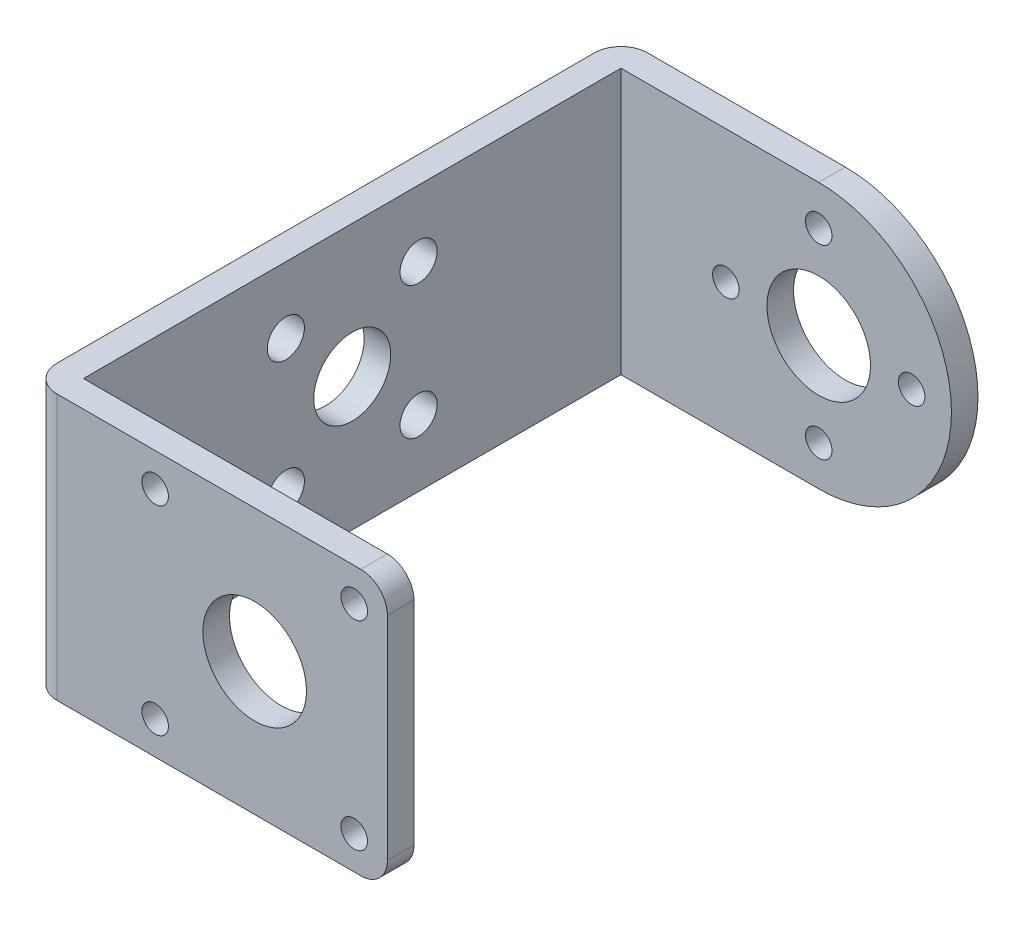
ISO-10303-21;
HEADER;
FILE_DESCRIPTION(('STEP AP214'),'2;1');
FILE_NAME('part.step','',(''),(''),'','','');
FILE_SCHEMA(('AUTOMOTIVE_DESIGN { 1 0 10303 214 1 1 1 1 }'));
ENDSEC;
DATA;
#1=APPLICATION_CONTEXT('core data for automotive mechanical design processes');
#2=APPLICATION_PROTOCOL_DEFINITION('international standard','automotive_design',2000,#1);
#3=PRODUCT_CONTEXT('',#1,'mechanical');
#4=PRODUCT('Part','Part','',(#3));
#5=PRODUCT_RELATED_PRODUCT_CATEGORY('part','',(#4));
#6=PRODUCT_DEFINITION_FORMATION('','',#4);
#7=PRODUCT_DEFINITION_CONTEXT('part definition',#1,'design');
#8=PRODUCT_DEFINITION('design','',#6,#7);
#9=PRODUCT_DEFINITION_SHAPE('','',#8);
#10=(LENGTH_UNIT() NAMED_UNIT(*) SI_UNIT(.MILLI.,.METRE.));
#11=(NAMED_UNIT(*) PLANE_ANGLE_UNIT() SI_UNIT($,.RADIAN.));
#12=(NAMED_UNIT(*) SI_UNIT($,.STERADIAN.) SOLID_ANGLE_UNIT());
#13=UNCERTAINTY_MEASURE_WITH_UNIT(LENGTH_MEASURE(1.E-05),#10,'distance_accuracy_value','');
#14=(GEOMETRIC_REPRESENTATION_CONTEXT(3) GLOBAL_UNCERTAINTY_ASSIGNED_CONTEXT((#13)) GLOBAL_UNIT_ASSIGNED_CONTEXT((#10,
#11,#12)) REPRESENTATION_CONTEXT('',''));
#15=CARTESIAN_POINT('',(0.,0.,0.));
#16=DIRECTION('',(0.,0.,1.));
#17=DIRECTION('',(1.,0.,0.));
#18=AXIS2_PLACEMENT_3D('',#15,#16,#17);
#19=CARTESIAN_POINT('',(-13.45,0.,0.));
#20=DIRECTION('',(0.,1.,0.));
#21=DIRECTION('',(0.,0.,1.));
#22=AXIS2_PLACEMENT_3D('',#19,#20,#21);
#23=PLANE('',#22);
#24=CARTESIAN_POINT('',(-24.9,0.,20.25));
#25=DIRECTION('',(0.,1.,0.));
#26=DIRECTION('',(-0.707106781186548,0.,0.707106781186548));
#27=AXIS2_PLACEMENT_3D('',#24,#25,#26);
#28=CIRCLE('',#27,2.);
#29=CARTESIAN_POINT('',(-26.9,0.,20.25));
#30=VERTEX_POINT('',#29);
#31=CARTESIAN_POINT('',(-24.9,0.,22.25));
#32=VERTEX_POINT('',#31);
#33=EDGE_CURVE('E551',#30,#32,#28,.T.);
#34=ORIENTED_EDGE('',*,*,#33,.F.);
#35=DIRECTION('',(0.,0.,-1.));
#36=VECTOR('',#35,1.);
#37=CARTESIAN_POINT('',(-26.9,0.,22.25));
#38=LINE('',#37,#36);
#39=CARTESIAN_POINT('',(-26.9,0.,-20.25));
#40=VERTEX_POINT('',#39);
#41=EDGE_CURVE('E583',#30,#40,#38,.T.);
#42=ORIENTED_EDGE('',*,*,#41,.T.);
#43=CARTESIAN_POINT('',(-24.9,0.,-20.25));
#44=DIRECTION('',(0.,1.,0.));
#45=DIRECTION('',(-0.707106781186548,0.,-0.707106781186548));
#46=AXIS2_PLACEMENT_3D('',#43,#44,#45);
#47=CIRCLE('',#46,2.);
#48=CARTESIAN_POINT('',(-24.9,0.,-22.25));
#49=VERTEX_POINT('',#48);
#50=EDGE_CURVE('E328',#49,#40,#47,.T.);
#51=ORIENTED_EDGE('',*,*,#50,.F.);
#52=DIRECTION('',(1.,0.,0.));
#53=VECTOR('',#52,1.);
#54=CARTESIAN_POINT('',(-26.9,0.,-22.25));
#55=LINE('',#54,#53);
#56=CARTESIAN_POINT('',(-10.,0.,-22.25));
#57=VERTEX_POINT('',#56);
#58=EDGE_CURVE('E329',#49,#57,#55,.T.);
#59=ORIENTED_EDGE('',*,*,#58,.T.);
#60=DIRECTION('',(0.,0.,-1.));
#61=VECTOR('',#60,1.);
#62=CARTESIAN_POINT('',(-10.,0.,-22.25));
#63=LINE('',#62,#61);
#64=CARTESIAN_POINT('',(-10.,0.,-20.25));
#65=VERTEX_POINT('',#64);
#66=EDGE_CURVE('E478',#65,#57,#63,.T.);
#67=ORIENTED_EDGE('',*,*,#66,.F.);
#68=DIRECTION('',(1.,0.,0.));
#69=VECTOR('',#68,1.);
#70=CARTESIAN_POINT('',(-24.9,0.,-20.25));
#71=LINE('',#70,#69);
#72=CARTESIAN_POINT('',(-24.9,0.,-20.25));
#73=VERTEX_POINT('',#72);
#74=EDGE_CURVE('E20',#73,#65,#71,.T.);
#75=ORIENTED_EDGE('',*,*,#74,.F.);
#76=DIRECTION('',(0.,0.,-1.));
#77=VECTOR('',#76,1.);
#78=CARTESIAN_POINT('',(-24.9,0.,20.25));
#79=LINE('',#78,#77);
#80=CARTESIAN_POINT('',(-24.9,0.,20.25));
#81=VERTEX_POINT('',#80);
#82=EDGE_CURVE('E11',#81,#73,#79,.T.);
#83=ORIENTED_EDGE('',*,*,#82,.F.);
#84=DIRECTION('',(-1.,0.,0.));
#85=VECTOR('',#84,1.);
#86=CARTESIAN_POINT('',(0.,0.,20.25));
#87=LINE('',#86,#85);
#88=CARTESIAN_POINT('',(-2.,0.,20.25));
#89=VERTEX_POINT('',#88);
#90=EDGE_CURVE('E367',#89,#81,#87,.T.);
#91=ORIENTED_EDGE('',*,*,#90,.F.);
#92=DIRECTION('',(0.,0.,-1.));
#93=VECTOR('',#92,1.);
#94=CARTESIAN_POINT('',(-2.,0.,11.125));
#95=LINE('',#94,#93);
#96=CARTESIAN_POINT('',(-2.,0.,22.25));
#97=VERTEX_POINT('',#96);
#98=EDGE_CURVE('E350',#97,#89,#95,.T.);
#99=ORIENTED_EDGE('',*,*,#98,.F.);
#100=DIRECTION('',(-1.,0.,0.));
#101=VECTOR('',#100,1.);
#102=CARTESIAN_POINT('',(0.,0.,22.25));
#103=LINE('',#102,#101);
#104=EDGE_CURVE('E510',#97,#32,#103,.T.);
#105=ORIENTED_EDGE('',*,*,#104,.T.);
#106=EDGE_LOOP('',(#34,#42,#51,#59,#67,#75,#83,#91,#99,#105));
#107=FACE_BOUND('',#106,.T.);
#108=ADVANCED_FACE('F17',(#107),#23,.F.);
#109=CARTESIAN_POINT('',(-24.9,0.,20.25));
#110=DIRECTION('',(1.,0.,0.));
#111=DIRECTION('',(0.,-1.,0.));
#112=AXIS2_PLACEMENT_3D('',#109,#110,#111);
#113=PLANE('',#112);
#114=CARTESIAN_POINT('',(-24.9,5.,5.));
#115=DIRECTION('',(-1.,0.,0.));
#116=DIRECTION('',(0.,0.,1.));
#117=AXIS2_PLACEMENT_3D('',#114,#115,#116);
#118=CIRCLE('',#117,1.4);
#119=CARTESIAN_POINT('',(-24.9,5.,3.6));
#120=VERTEX_POINT('',#119);
#121=EDGE_CURVE('E445',#120,#120,#118,.T.);
#122=ORIENTED_EDGE('',*,*,#121,.T.);
#123=EDGE_LOOP('',(#122));
#124=FACE_BOUND('',#123,.T.);
#125=CARTESIAN_POINT('',(-24.9,10.,0.));
#126=DIRECTION('',(-1.,0.,0.));
#127=DIRECTION('',(0.,0.,1.));
#128=AXIS2_PLACEMENT_3D('',#125,#126,#127);
#129=CIRCLE('',#128,2.9);
#130=CARTESIAN_POINT('',(-24.9,10.,-2.9));
#131=VERTEX_POINT('',#130);
#132=EDGE_CURVE('E434',#131,#131,#129,.T.);
#133=ORIENTED_EDGE('',*,*,#132,.T.);
#134=EDGE_LOOP('',(#133));
#135=FACE_BOUND('',#134,.T.);
#136=CARTESIAN_POINT('',(-24.9,15.,5.));
#137=DIRECTION('',(-1.,0.,0.));
#138=DIRECTION('',(0.,0.,1.));
#139=AXIS2_PLACEMENT_3D('',#136,#137,#138);
#140=CIRCLE('',#139,1.4);
#141=CARTESIAN_POINT('',(-24.9,15.,3.6));
#142=VERTEX_POINT('',#141);
#143=EDGE_CURVE('E261',#142,#142,#140,.T.);
#144=ORIENTED_EDGE('',*,*,#143,.T.);
#145=EDGE_LOOP('',(#144));
#146=FACE_BOUND('',#145,.T.);
#147=CARTESIAN_POINT('',(-24.9,5.,-5.));
#148=DIRECTION('',(-1.,0.,0.));
#149=DIRECTION('',(0.,0.,1.));
#150=AXIS2_PLACEMENT_3D('',#147,#148,#149);
#151=CIRCLE('',#150,1.4);
#152=CARTESIAN_POINT('',(-24.9,5.,-6.4));
#153=VERTEX_POINT('',#152);
#154=EDGE_CURVE('E263',#153,#153,#151,.T.);
#155=ORIENTED_EDGE('',*,*,#154,.T.);
#156=EDGE_LOOP('',(#155));
#157=FACE_BOUND('',#156,.T.);
#158=CARTESIAN_POINT('',(-24.9,15.,-5.));
#159=DIRECTION('',(-1.,0.,0.));
#160=DIRECTION('',(0.,0.,1.));
#161=AXIS2_PLACEMENT_3D('',#158,#159,#160);
#162=CIRCLE('',#161,1.4);
#163=CARTESIAN_POINT('',(-24.9,15.,-6.4));
#164=VERTEX_POINT('',#163);
#165=EDGE_CURVE('E421',#164,#164,#162,.T.);
#166=ORIENTED_EDGE('',*,*,#165,.T.);
#167=EDGE_LOOP('',(#166));
#168=FACE_BOUND('',#167,.T.);
#169=ORIENTED_EDGE('',*,*,#82,.T.);
#170=DIRECTION('',(0.,1.,0.));
#171=VECTOR('',#170,1.);
#172=CARTESIAN_POINT('',(-24.9,0.,-20.25));
#173=LINE('',#172,#171);
#174=CARTESIAN_POINT('',(-24.9,20.,-20.25));
#175=VERTEX_POINT('',#174);
#176=EDGE_CURVE('E507',#73,#175,#173,.T.);
#177=ORIENTED_EDGE('',*,*,#176,.T.);
#178=DIRECTION('',(0.,0.,-1.));
#179=VECTOR('',#178,1.);
#180=CARTESIAN_POINT('',(-24.9,20.,20.25));
#181=LINE('',#180,#179);
#182=CARTESIAN_POINT('',(-24.9,20.,20.25));
#183=VERTEX_POINT('',#182);
#184=EDGE_CURVE('E285',#183,#175,#181,.T.);
#185=ORIENTED_EDGE('',*,*,#184,.F.);
#186=DIRECTION('',(0.,1.,0.));
#187=VECTOR('',#186,1.);
#188=CARTESIAN_POINT('',(-24.9,0.,20.25));
#189=LINE('',#188,#187);
#190=EDGE_CURVE('E372',#81,#183,#189,.T.);
#191=ORIENTED_EDGE('',*,*,#190,.F.);
#192=EDGE_LOOP('',(#169,#177,#185,#191));
#193=FACE_BOUND('',#192,.T.);
#194=ADVANCED_FACE('F534',(#124,#135,#146,#157,#168,#193),#113,.T.);
#195=CARTESIAN_POINT('',(-24.9,0.,-20.25));
#196=DIRECTION('',(0.,0.,1.));
#197=DIRECTION('',(0.,1.,0.));
#198=AXIS2_PLACEMENT_3D('',#195,#196,#197);
#199=PLANE('',#198);
#200=CARTESIAN_POINT('',(-10.,17.,-20.25));
#201=DIRECTION('',(0.,0.,-1.));
#202=DIRECTION('',(-1.,0.,0.));
#203=AXIS2_PLACEMENT_3D('',#200,#201,#202);
#204=CIRCLE('',#203,1.);
#205=CARTESIAN_POINT('',(-9.,17.,-20.25));
#206=VERTEX_POINT('',#205);
#207=EDGE_CURVE('E322',#206,#206,#204,.T.);
#208=ORIENTED_EDGE('',*,*,#207,.T.);
#209=EDGE_LOOP('',(#208));
#210=FACE_BOUND('',#209,.T.);
#211=CARTESIAN_POINT('',(-10.,10.,-20.25));
#212=DIRECTION('',(0.,0.,-1.));
#213=DIRECTION('',(-1.,0.,0.));
#214=AXIS2_PLACEMENT_3D('',#211,#212,#213);
#215=CIRCLE('',#214,3.9);
#216=CARTESIAN_POINT('',(-6.1,10.,-20.25));
#217=VERTEX_POINT('',#216);
#218=EDGE_CURVE('E489',#217,#217,#215,.T.);
#219=ORIENTED_EDGE('',*,*,#218,.T.);
#220=EDGE_LOOP('',(#219));
#221=FACE_BOUND('',#220,.T.);
#222=CARTESIAN_POINT('',(-17.,10.,-20.25));
#223=DIRECTION('',(0.,0.,-1.));
#224=DIRECTION('',(-1.,0.,0.));
#225=AXIS2_PLACEMENT_3D('',#222,#223,#224);
#226=CIRCLE('',#225,1.);
#227=CARTESIAN_POINT('',(-16.,10.,-20.25));
#228=VERTEX_POINT('',#227);
#229=EDGE_CURVE('E341',#228,#228,#226,.T.);
#230=ORIENTED_EDGE('',*,*,#229,.T.);
#231=EDGE_LOOP('',(#230));
#232=FACE_BOUND('',#231,.T.);
#233=CARTESIAN_POINT('',(-3.,10.,-20.25));
#234=DIRECTION('',(0.,0.,-1.));
#235=DIRECTION('',(-1.,0.,0.));
#236=AXIS2_PLACEMENT_3D('',#233,#234,#235);
#237=CIRCLE('',#236,1.);
#238=CARTESIAN_POINT('',(-2.,10.,-20.25));
#239=VERTEX_POINT('',#238);
#240=EDGE_CURVE('E463',#239,#239,#237,.T.);
#241=ORIENTED_EDGE('',*,*,#240,.T.);
#242=EDGE_LOOP('',(#241));
#243=FACE_BOUND('',#242,.T.);
#244=CARTESIAN_POINT('',(-10.,3.,-20.25));
#245=DIRECTION('',(0.,0.,-1.));
#246=DIRECTION('',(-1.,0.,0.));
#247=AXIS2_PLACEMENT_3D('',#244,#245,#246);
#248=CIRCLE('',#247,1.);
#249=CARTESIAN_POINT('',(-9.,3.,-20.25));
#250=VERTEX_POINT('',#249);
#251=EDGE_CURVE('E453',#250,#250,#248,.T.);
#252=ORIENTED_EDGE('',*,*,#251,.T.);
#253=EDGE_LOOP('',(#252));
#254=FACE_BOUND('',#253,.T.);
#255=CARTESIAN_POINT('',(-10.,10.,-20.25));
#256=DIRECTION('',(0.,0.,1.));
#257=DIRECTION('',(-1.,0.,0.));
#258=AXIS2_PLACEMENT_3D('',#255,#256,#257);
#259=CIRCLE('',#258,10.);
#260=CARTESIAN_POINT('',(-10.,20.,-20.25));
#261=VERTEX_POINT('',#260);
#262=EDGE_CURVE('E471',#65,#261,#259,.T.);
#263=ORIENTED_EDGE('',*,*,#262,.T.);
#264=DIRECTION('',(1.,0.,0.));
#265=VECTOR('',#264,1.);
#266=CARTESIAN_POINT('',(-24.9,20.,-20.25));
#267=LINE('',#266,#265);
#268=EDGE_CURVE('E287',#175,#261,#267,.T.);
#269=ORIENTED_EDGE('',*,*,#268,.F.);
#270=ORIENTED_EDGE('',*,*,#176,.F.);
#271=ORIENTED_EDGE('',*,*,#74,.T.);
#272=EDGE_LOOP('',(#263,#269,#270,#271));
#273=FACE_BOUND('',#272,.T.);
#274=ADVANCED_FACE('F518',(#210,#221,#232,#243,#254,#273),#199,.T.);
#275=CARTESIAN_POINT('',(-26.9,0.,22.25));
#276=DIRECTION('',(0.,0.,1.));
#277=DIRECTION('',(0.,1.,0.));
#278=AXIS2_PLACEMENT_3D('',#275,#276,#277);
#279=PLANE('',#278);
#280=CARTESIAN_POINT('',(-17.5,17.5,22.25));
#281=DIRECTION('',(0.,0.,-1.));
#282=DIRECTION('',(1.,0.,0.));
#283=AXIS2_PLACEMENT_3D('',#280,#281,#282);
#284=CIRCLE('',#283,1.);
#285=CARTESIAN_POINT('',(-18.5,17.5,22.25));
#286=VERTEX_POINT('',#285);
#287=EDGE_CURVE('E503',#286,#286,#284,.T.);
#288=ORIENTED_EDGE('',*,*,#287,.T.);
#289=EDGE_LOOP('',(#288));
#290=FACE_BOUND('',#289,.T.);
#291=CARTESIAN_POINT('',(-10.,10.,22.25));
#292=DIRECTION('',(0.,0.,-1.));
#293=DIRECTION('',(1.,0.,0.));
#294=AXIS2_PLACEMENT_3D('',#291,#292,#293);
#295=CIRCLE('',#294,3.9);
#296=CARTESIAN_POINT('',(-13.9,10.,22.25));
#297=VERTEX_POINT('',#296);
#298=EDGE_CURVE('E305',#297,#297,#295,.T.);
#299=ORIENTED_EDGE('',*,*,#298,.T.);
#300=EDGE_LOOP('',(#299));
#301=FACE_BOUND('',#300,.T.);
#302=CARTESIAN_POINT('',(-2.5,17.5,22.25));
#303=DIRECTION('',(0.,0.,-1.));
#304=DIRECTION('',(1.,0.,0.));
#305=AXIS2_PLACEMENT_3D('',#302,#303,#304);
#306=CIRCLE('',#305,1.);
#307=CARTESIAN_POINT('',(-3.5,17.5,22.25));
#308=VERTEX_POINT('',#307);
#309=EDGE_CURVE('E303',#308,#308,#306,.T.);
#310=ORIENTED_EDGE('',*,*,#309,.T.);
#311=EDGE_LOOP('',(#310));
#312=FACE_BOUND('',#311,.T.);
#313=CARTESIAN_POINT('',(-17.5,2.5,22.25));
#314=DIRECTION('',(0.,0.,-1.));
#315=DIRECTION('',(1.,0.,0.));
#316=AXIS2_PLACEMENT_3D('',#313,#314,#315);
#317=CIRCLE('',#316,1.);
#318=CARTESIAN_POINT('',(-18.5,2.5,22.25));
#319=VERTEX_POINT('',#318);
#320=EDGE_CURVE('E284',#319,#319,#317,.T.);
#321=ORIENTED_EDGE('',*,*,#320,.T.);
#322=EDGE_LOOP('',(#321));
#323=FACE_BOUND('',#322,.T.);
#324=CARTESIAN_POINT('',(-2.5,2.5,22.25));
#325=DIRECTION('',(0.,0.,-1.));
#326=DIRECTION('',(1.,0.,0.));
#327=AXIS2_PLACEMENT_3D('',#324,#325,#326);
#328=CIRCLE('',#327,1.);
#329=CARTESIAN_POINT('',(-3.5,2.5,22.25));
#330=VERTEX_POINT('',#329);
#331=EDGE_CURVE('E334',#330,#330,#328,.T.);
#332=ORIENTED_EDGE('',*,*,#331,.T.);
#333=EDGE_LOOP('',(#332));
#334=FACE_BOUND('',#333,.T.);
#335=DIRECTION('',(0.,1.,0.));
#336=VECTOR('',#335,1.);
#337=CARTESIAN_POINT('',(-24.9,0.,22.25));
#338=LINE('',#337,#336);
#339=CARTESIAN_POINT('',(-24.9,20.,22.25));
#340=VERTEX_POINT('',#339);
#341=EDGE_CURVE('E547',#32,#340,#338,.T.);
#342=ORIENTED_EDGE('',*,*,#341,.F.);
#343=ORIENTED_EDGE('',*,*,#104,.F.);
#344=CARTESIAN_POINT('',(-2.,2.,22.25));
#345=DIRECTION('',(0.,0.,-1.));
#346=DIRECTION('',(0.707106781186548,-0.707106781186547,0.));
#347=AXIS2_PLACEMENT_3D('',#344,#345,#346);
#348=CIRCLE('',#347,2.);
#349=CARTESIAN_POINT('',(0.,2.,22.25));
#350=VERTEX_POINT('',#349);
#351=EDGE_CURVE('E336',#350,#97,#348,.T.);
#352=ORIENTED_EDGE('',*,*,#351,.F.);
#353=DIRECTION('',(0.,1.,0.));
#354=VECTOR('',#353,1.);
#355=CARTESIAN_POINT('',(0.,0.,22.25));
#356=LINE('',#355,#354);
#357=CARTESIAN_POINT('',(0.,18.,22.25));
#358=VERTEX_POINT('',#357);
#359=EDGE_CURVE('E361',#350,#358,#356,.T.);
#360=ORIENTED_EDGE('',*,*,#359,.T.);
#361=CARTESIAN_POINT('',(-2.,18.,22.25));
#362=DIRECTION('',(0.,0.,-1.));
#363=DIRECTION('',(0.707106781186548,0.707106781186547,0.));
#364=AXIS2_PLACEMENT_3D('',#361,#362,#363);
#365=CIRCLE('',#364,2.);
#366=CARTESIAN_POINT('',(-2.,20.,22.25));
#367=VERTEX_POINT('',#366);
#368=EDGE_CURVE('E407',#367,#358,#365,.T.);
#369=ORIENTED_EDGE('',*,*,#368,.F.);
#370=DIRECTION('',(1.,0.,0.));
#371=VECTOR('',#370,1.);
#372=CARTESIAN_POINT('',(0.,20.,22.25));
#373=LINE('',#372,#371);
#374=EDGE_CURVE('E295',#340,#367,#373,.T.);
#375=ORIENTED_EDGE('',*,*,#374,.F.);
#376=EDGE_LOOP('',(#342,#343,#352,#360,#369,#375));
#377=FACE_BOUND('',#376,.T.);
#378=ADVANCED_FACE('F544',(#290,#301,#312,#323,#334,#377),#279,.T.);
#379=CARTESIAN_POINT('',(-17.5,17.5,22.25));
#380=DIRECTION('',(0.,0.,-1.));
#381=DIRECTION('',(1.,0.,0.));
#382=AXIS2_PLACEMENT_3D('',#379,#380,#381);
#383=CYLINDRICAL_SURFACE('',#382,1.);
#384=ORIENTED_EDGE('',*,*,#287,.F.);
#385=DIRECTION('',(0.,0.,-1.));
#386=VECTOR('',#385,1.);
#387=CARTESIAN_POINT('',(-18.5,17.5,22.25));
#388=LINE('',#387,#386);
#389=CARTESIAN_POINT('',(-18.5,17.5,20.25));
#390=VERTEX_POINT('',#389);
#391=EDGE_CURVE('E46',#286,#390,#388,.T.);
#392=ORIENTED_EDGE('',*,*,#391,.T.);
#393=CARTESIAN_POINT('',(-17.5,17.5,20.25));
#394=DIRECTION('',(0.,0.,1.));
#395=DIRECTION('',(1.,0.,0.));
#396=AXIS2_PLACEMENT_3D('',#393,#394,#395);
#397=CIRCLE('',#396,1.);
#398=EDGE_CURVE('E402',#390,#390,#397,.T.);
#399=ORIENTED_EDGE('',*,*,#398,.F.);
#400=ORIENTED_EDGE('',*,*,#391,.F.);
#401=EDGE_LOOP('',(#384,#392,#399,#400));
#402=FACE_BOUND('',#401,.T.);
#403=ADVANCED_FACE('F635',(#402),#383,.F.);
#404=CARTESIAN_POINT('',(-10.,10.,22.25));
#405=DIRECTION('',(0.,0.,-1.));
#406=DIRECTION('',(1.,0.,0.));
#407=AXIS2_PLACEMENT_3D('',#404,#405,#406);
#408=CYLINDRICAL_SURFACE('',#407,3.9);
#409=ORIENTED_EDGE('',*,*,#298,.F.);
#410=DIRECTION('',(0.,0.,-1.));
#411=VECTOR('',#410,1.);
#412=CARTESIAN_POINT('',(-13.9,10.,22.25));
#413=LINE('',#412,#411);
#414=CARTESIAN_POINT('',(-13.9,10.,20.25));
#415=VERTEX_POINT('',#414);
#416=EDGE_CURVE('E501',#297,#415,#413,.T.);
#417=ORIENTED_EDGE('',*,*,#416,.T.);
#418=CARTESIAN_POINT('',(-10.,10.,20.25));
#419=DIRECTION('',(0.,0.,1.));
#420=DIRECTION('',(1.,0.,0.));
#421=AXIS2_PLACEMENT_3D('',#418,#419,#420);
#422=CIRCLE('',#421,3.9);
#423=EDGE_CURVE('E399',#415,#415,#422,.T.);
#424=ORIENTED_EDGE('',*,*,#423,.F.);
#425=ORIENTED_EDGE('',*,*,#416,.F.);
#426=EDGE_LOOP('',(#409,#417,#424,#425));
#427=FACE_BOUND('',#426,.T.);
#428=ADVANCED_FACE('F638',(#427),#408,.F.);
#429=CARTESIAN_POINT('',(-2.5,17.5,22.25));
#430=DIRECTION('',(0.,0.,-1.));
#431=DIRECTION('',(1.,0.,0.));
#432=AXIS2_PLACEMENT_3D('',#429,#430,#431);
#433=CYLINDRICAL_SURFACE('',#432,1.);
#434=ORIENTED_EDGE('',*,*,#309,.F.);
#435=DIRECTION('',(0.,0.,-1.));
#436=VECTOR('',#435,1.);
#437=CARTESIAN_POINT('',(-3.5,17.5,22.25));
#438=LINE('',#437,#436);
#439=CARTESIAN_POINT('',(-3.5,17.5,20.25));
#440=VERTEX_POINT('',#439);
#441=EDGE_CURVE('E298',#308,#440,#438,.T.);
#442=ORIENTED_EDGE('',*,*,#441,.T.);
#443=CARTESIAN_POINT('',(-2.5,17.5,20.25));
#444=DIRECTION('',(0.,0.,1.));
#445=DIRECTION('',(1.,0.,0.));
#446=AXIS2_PLACEMENT_3D('',#443,#444,#445);
#447=CIRCLE('',#446,1.);
#448=EDGE_CURVE('E396',#440,#440,#447,.T.);
#449=ORIENTED_EDGE('',*,*,#448,.F.);
#450=ORIENTED_EDGE('',*,*,#441,.F.);
#451=EDGE_LOOP('',(#434,#442,#449,#450));
#452=FACE_BOUND('',#451,.T.);
#453=ADVANCED_FACE('F637',(#452),#433,.F.);
#454=CARTESIAN_POINT('',(-17.5,2.5,22.25));
#455=DIRECTION('',(0.,0.,-1.));
#456=DIRECTION('',(1.,0.,0.));
#457=AXIS2_PLACEMENT_3D('',#454,#455,#456);
#458=CYLINDRICAL_SURFACE('',#457,1.);
#459=ORIENTED_EDGE('',*,*,#320,.F.);
#460=DIRECTION('',(0.,0.,-1.));
#461=VECTOR('',#460,1.);
#462=CARTESIAN_POINT('',(-18.5,2.5,22.25));
#463=LINE('',#462,#461);
#464=CARTESIAN_POINT('',(-18.5,2.5,20.25));
#465=VERTEX_POINT('',#464);
#466=EDGE_CURVE('E378',#319,#465,#463,.T.);
#467=ORIENTED_EDGE('',*,*,#466,.T.);
#468=CARTESIAN_POINT('',(-17.5,2.5,20.25));
#469=DIRECTION('',(0.,0.,1.));
#470=DIRECTION('',(1.,0.,0.));
#471=AXIS2_PLACEMENT_3D('',#468,#469,#470);
#472=CIRCLE('',#471,1.);
#473=EDGE_CURVE('E389',#465,#465,#472,.T.);
#474=ORIENTED_EDGE('',*,*,#473,.F.);
#475=ORIENTED_EDGE('',*,*,#466,.F.);
#476=EDGE_LOOP('',(#459,#467,#474,#475));
#477=FACE_BOUND('',#476,.T.);
#478=ADVANCED_FACE('F613',(#477),#458,.F.);
#479=CARTESIAN_POINT('',(-2.5,2.5,22.25));
#480=DIRECTION('',(0.,0.,-1.));
#481=DIRECTION('',(1.,0.,0.));
#482=AXIS2_PLACEMENT_3D('',#479,#480,#481);
#483=CYLINDRICAL_SURFACE('',#482,1.);
#484=ORIENTED_EDGE('',*,*,#331,.F.);
#485=DIRECTION('',(0.,0.,-1.));
#486=VECTOR('',#485,1.);
#487=CARTESIAN_POINT('',(-3.5,2.5,22.25));
#488=LINE('',#487,#486);
#489=CARTESIAN_POINT('',(-3.5,2.5,20.25));
#490=VERTEX_POINT('',#489);
#491=EDGE_CURVE('E392',#330,#490,#488,.T.);
#492=ORIENTED_EDGE('',*,*,#491,.T.);
#493=CARTESIAN_POINT('',(-2.5,2.5,20.25));
#494=DIRECTION('',(0.,0.,1.));
#495=DIRECTION('',(1.,0.,0.));
#496=AXIS2_PLACEMENT_3D('',#493,#494,#495);
#497=CIRCLE('',#496,1.);
#498=EDGE_CURVE('E383',#490,#490,#497,.T.);
#499=ORIENTED_EDGE('',*,*,#498,.F.);
#500=ORIENTED_EDGE('',*,*,#491,.F.);
#501=EDGE_LOOP('',(#484,#492,#499,#500));
#502=FACE_BOUND('',#501,.T.);
#503=ADVANCED_FACE('F605',(#502),#483,.F.);
#504=CARTESIAN_POINT('',(0.,0.,-22.25));
#505=DIRECTION('',(0.,0.,-1.));
#506=DIRECTION('',(-1.,0.,0.));
#507=AXIS2_PLACEMENT_3D('',#504,#505,#506);
#508=PLANE('',#507);
#509=CARTESIAN_POINT('',(-10.,3.,-22.25));
#510=DIRECTION('',(0.,0.,1.));
#511=DIRECTION('',(-1.,0.,0.));
#512=AXIS2_PLACEMENT_3D('',#509,#510,#511);
#513=CIRCLE('',#512,1.);
#514=CARTESIAN_POINT('',(-9.,3.,-22.25));
#515=VERTEX_POINT('',#514);
#516=EDGE_CURVE('E443',#515,#515,#513,.T.);
#517=ORIENTED_EDGE('',*,*,#516,.T.);
#518=EDGE_LOOP('',(#517));
#519=FACE_BOUND('',#518,.T.);
#520=CARTESIAN_POINT('',(-3.,10.,-22.25));
#521=DIRECTION('',(0.,0.,1.));
#522=DIRECTION('',(-1.,0.,0.));
#523=AXIS2_PLACEMENT_3D('',#520,#521,#522);
#524=CIRCLE('',#523,1.);
#525=CARTESIAN_POINT('',(-2.,10.,-22.25));
#526=VERTEX_POINT('',#525);
#527=EDGE_CURVE('E460',#526,#526,#524,.T.);
#528=ORIENTED_EDGE('',*,*,#527,.T.);
#529=EDGE_LOOP('',(#528));
#530=FACE_BOUND('',#529,.T.);
#531=CARTESIAN_POINT('',(-17.,10.,-22.25));
#532=DIRECTION('',(0.,0.,1.));
#533=DIRECTION('',(-1.,0.,0.));
#534=AXIS2_PLACEMENT_3D('',#531,#532,#533);
#535=CIRCLE('',#534,1.);
#536=CARTESIAN_POINT('',(-16.,10.,-22.25));
#537=VERTEX_POINT('',#536);
#538=EDGE_CURVE('E345',#537,#537,#535,.T.);
#539=ORIENTED_EDGE('',*,*,#538,.T.);
#540=EDGE_LOOP('',(#539));
#541=FACE_BOUND('',#540,.T.);
#542=CARTESIAN_POINT('',(-10.,10.,-22.25));
#543=DIRECTION('',(0.,0.,1.));
#544=DIRECTION('',(-1.,0.,0.));
#545=AXIS2_PLACEMENT_3D('',#542,#543,#544);
#546=CIRCLE('',#545,3.9);
#547=CARTESIAN_POINT('',(-6.1,10.,-22.25));
#548=VERTEX_POINT('',#547);
#549=EDGE_CURVE('E414',#548,#548,#546,.T.);
#550=ORIENTED_EDGE('',*,*,#549,.T.);
#551=EDGE_LOOP('',(#550));
#552=FACE_BOUND('',#551,.T.);
#553=CARTESIAN_POINT('',(-10.,17.,-22.25));
#554=DIRECTION('',(0.,0.,1.));
#555=DIRECTION('',(-1.,0.,0.));
#556=AXIS2_PLACEMENT_3D('',#553,#554,#555);
#557=CIRCLE('',#556,1.);
#558=CARTESIAN_POINT('',(-9.,17.,-22.25));
#559=VERTEX_POINT('',#558);
#560=EDGE_CURVE('E324',#559,#559,#557,.T.);
#561=ORIENTED_EDGE('',*,*,#560,.T.);
#562=EDGE_LOOP('',(#561));
#563=FACE_BOUND('',#562,.T.);
#564=DIRECTION('',(0.,-1.,0.));
#565=VECTOR('',#564,1.);
#566=CARTESIAN_POINT('',(-24.9,0.,-22.25));
#567=LINE('',#566,#565);
#568=CARTESIAN_POINT('',(-24.9,20.,-22.25));
#569=VERTEX_POINT('',#568);
#570=EDGE_CURVE('E317',#569,#49,#567,.T.);
#571=ORIENTED_EDGE('',*,*,#570,.F.);
#572=DIRECTION('',(-1.,0.,0.));
#573=VECTOR('',#572,1.);
#574=CARTESIAN_POINT('',(-26.9,20.,-22.25));
#575=LINE('',#574,#573);
#576=CARTESIAN_POINT('',(-10.,20.,-22.25));
#577=VERTEX_POINT('',#576);
#578=EDGE_CURVE('E313',#577,#569,#575,.T.);
#579=ORIENTED_EDGE('',*,*,#578,.F.);
#580=CARTESIAN_POINT('',(-10.,10.,-22.25));
#581=DIRECTION('',(0.,0.,-1.));
#582=DIRECTION('',(-1.,0.,0.));
#583=AXIS2_PLACEMENT_3D('',#580,#581,#582);
#584=CIRCLE('',#583,10.);
#585=EDGE_CURVE('E467',#577,#57,#584,.T.);
#586=ORIENTED_EDGE('',*,*,#585,.T.);
#587=ORIENTED_EDGE('',*,*,#58,.F.);
#588=EDGE_LOOP('',(#571,#579,#586,#587));
#589=FACE_BOUND('',#588,.T.);
#590=ADVANCED_FACE('F597',(#519,#530,#541,#552,#563,#589),#508,.T.);
#591=CARTESIAN_POINT('',(-10.,17.,-22.25));
#592=DIRECTION('',(0.,0.,1.));
#593=DIRECTION('',(-1.,0.,0.));
#594=AXIS2_PLACEMENT_3D('',#591,#592,#593);
#595=CYLINDRICAL_SURFACE('',#594,1.);
#596=ORIENTED_EDGE('',*,*,#560,.F.);
#597=DIRECTION('',(0.,0.,1.));
#598=VECTOR('',#597,1.);
#599=CARTESIAN_POINT('',(-9.,17.,-22.25));
#600=LINE('',#599,#598);
#601=EDGE_CURVE('E319',#559,#206,#600,.T.);
#602=ORIENTED_EDGE('',*,*,#601,.T.);
#603=ORIENTED_EDGE('',*,*,#207,.F.);
#604=ORIENTED_EDGE('',*,*,#601,.F.);
#605=EDGE_LOOP('',(#596,#602,#603,#604));
#606=FACE_BOUND('',#605,.T.);
#607=ADVANCED_FACE('F601',(#606),#595,.F.);
#608=CARTESIAN_POINT('',(-10.,10.,-22.25));
#609=DIRECTION('',(0.,0.,1.));
#610=DIRECTION('',(-1.,0.,0.));
#611=AXIS2_PLACEMENT_3D('',#608,#609,#610);
#612=CYLINDRICAL_SURFACE('',#611,3.9);
#613=ORIENTED_EDGE('',*,*,#549,.F.);
#614=DIRECTION('',(0.,0.,1.));
#615=VECTOR('',#614,1.);
#616=CARTESIAN_POINT('',(-6.1,10.,-22.25));
#617=LINE('',#616,#615);
#618=EDGE_CURVE('E420',#548,#217,#617,.T.);
#619=ORIENTED_EDGE('',*,*,#618,.T.);
#620=ORIENTED_EDGE('',*,*,#218,.F.);
#621=ORIENTED_EDGE('',*,*,#618,.F.);
#622=EDGE_LOOP('',(#613,#619,#620,#621));
#623=FACE_BOUND('',#622,.T.);
#624=ADVANCED_FACE('F608',(#623),#612,.F.);
#625=CARTESIAN_POINT('',(-17.,10.,-22.25));
#626=DIRECTION('',(0.,0.,1.));
#627=DIRECTION('',(-1.,0.,0.));
#628=AXIS2_PLACEMENT_3D('',#625,#626,#627);
#629=CYLINDRICAL_SURFACE('',#628,1.);
#630=ORIENTED_EDGE('',*,*,#538,.F.);
#631=DIRECTION('',(0.,0.,1.));
#632=VECTOR('',#631,1.);
#633=CARTESIAN_POINT('',(-16.,10.,-22.25));
#634=LINE('',#633,#632);
#635=EDGE_CURVE('E337',#537,#228,#634,.T.);
#636=ORIENTED_EDGE('',*,*,#635,.T.);
#637=ORIENTED_EDGE('',*,*,#229,.F.);
#638=ORIENTED_EDGE('',*,*,#635,.F.);
#639=EDGE_LOOP('',(#630,#636,#637,#638));
#640=FACE_BOUND('',#639,.T.);
#641=ADVANCED_FACE('F951',(#640),#629,.F.);
#642=CARTESIAN_POINT('',(-10.,10.,-22.25));
#643=DIRECTION('',(0.,0.,1.));
#644=DIRECTION('',(1.,0.,0.));
#645=AXIS2_PLACEMENT_3D('',#642,#643,#644);
#646=CYLINDRICAL_SURFACE('',#645,10.);
#647=ORIENTED_EDGE('',*,*,#585,.F.);
#648=DIRECTION('',(0.,0.,-1.));
#649=VECTOR('',#648,1.);
#650=CARTESIAN_POINT('',(-10.,20.,-22.25));
#651=LINE('',#650,#649);
#652=EDGE_CURVE('E307',#261,#577,#651,.T.);
#653=ORIENTED_EDGE('',*,*,#652,.F.);
#654=ORIENTED_EDGE('',*,*,#262,.F.);
#655=ORIENTED_EDGE('',*,*,#66,.T.);
#656=EDGE_LOOP('',(#647,#653,#654,#655));
#657=FACE_BOUND('',#656,.T.);
#658=ADVANCED_FACE('F528',(#657),#646,.T.);
#659=CARTESIAN_POINT('',(-3.,10.,-22.25));
#660=DIRECTION('',(0.,0.,1.));
#661=DIRECTION('',(-1.,0.,0.));
#662=AXIS2_PLACEMENT_3D('',#659,#660,#661);
#663=CYLINDRICAL_SURFACE('',#662,1.);
#664=ORIENTED_EDGE('',*,*,#527,.F.);
#665=DIRECTION('',(0.,0.,1.));
#666=VECTOR('',#665,1.);
#667=CARTESIAN_POINT('',(-2.,10.,-22.25));
#668=LINE('',#667,#666);
#669=EDGE_CURVE('E459',#526,#239,#668,.T.);
#670=ORIENTED_EDGE('',*,*,#669,.T.);
#671=ORIENTED_EDGE('',*,*,#240,.F.);
#672=ORIENTED_EDGE('',*,*,#669,.F.);
#673=EDGE_LOOP('',(#664,#670,#671,#672));
#674=FACE_BOUND('',#673,.T.);
#675=ADVANCED_FACE('F864',(#674),#663,.F.);
#676=CARTESIAN_POINT('',(-10.,3.,-22.25));
#677=DIRECTION('',(0.,0.,1.));
#678=DIRECTION('',(-1.,0.,0.));
#679=AXIS2_PLACEMENT_3D('',#676,#677,#678);
#680=CYLINDRICAL_SURFACE('',#679,1.);
#681=ORIENTED_EDGE('',*,*,#516,.F.);
#682=DIRECTION('',(0.,0.,1.));
#683=VECTOR('',#682,1.);
#684=CARTESIAN_POINT('',(-9.,3.,-22.25));
#685=LINE('',#684,#683);
#686=EDGE_CURVE('E448',#515,#250,#685,.T.);
#687=ORIENTED_EDGE('',*,*,#686,.T.);
#688=ORIENTED_EDGE('',*,*,#251,.F.);
#689=ORIENTED_EDGE('',*,*,#686,.F.);
#690=EDGE_LOOP('',(#681,#687,#688,#689));
#691=FACE_BOUND('',#690,.T.);
#692=ADVANCED_FACE('F856',(#691),#680,.F.);
#693=CARTESIAN_POINT('',(-26.9,5.,5.));
#694=DIRECTION('',(1.,0.,0.));
#695=DIRECTION('',(0.,0.,1.));
#696=AXIS2_PLACEMENT_3D('',#693,#694,#695);
#697=CYLINDRICAL_SURFACE('',#696,1.4);
#698=CARTESIAN_POINT('',(-26.9,5.,5.));
#699=DIRECTION('',(1.,0.,0.));
#700=DIRECTION('',(0.,0.,1.));
#701=AXIS2_PLACEMENT_3D('',#698,#699,#700);
#702=CIRCLE('',#701,1.4);
#703=CARTESIAN_POINT('',(-26.9,5.,3.6));
#704=VERTEX_POINT('',#703);
#705=EDGE_CURVE('E280',#704,#704,#702,.T.);
#706=ORIENTED_EDGE('',*,*,#705,.F.);
#707=DIRECTION('',(1.,0.,0.));
#708=VECTOR('',#707,1.);
#709=CARTESIAN_POINT('',(-26.9,5.,3.6));
#710=LINE('',#709,#708);
#711=EDGE_CURVE('E437',#704,#120,#710,.T.);
#712=ORIENTED_EDGE('',*,*,#711,.T.);
#713=ORIENTED_EDGE('',*,*,#121,.F.);
#714=ORIENTED_EDGE('',*,*,#711,.F.);
#715=EDGE_LOOP('',(#706,#712,#713,#714));
#716=FACE_BOUND('',#715,.T.);
#717=ADVANCED_FACE('F861',(#716),#697,.F.);
#718=CARTESIAN_POINT('',(-26.9,10.,0.));
#719=DIRECTION('',(1.,0.,0.));
#720=DIRECTION('',(0.,0.,1.));
#721=AXIS2_PLACEMENT_3D('',#718,#719,#720);
#722=CYLINDRICAL_SURFACE('',#721,2.9);
#723=CARTESIAN_POINT('',(-26.9,10.,0.));
#724=DIRECTION('',(1.,0.,0.));
#725=DIRECTION('',(0.,0.,1.));
#726=AXIS2_PLACEMENT_3D('',#723,#724,#725);
#727=CIRCLE('',#726,2.9);
#728=CARTESIAN_POINT('',(-26.9,10.,-2.9));
#729=VERTEX_POINT('',#728);
#730=EDGE_CURVE('E267',#729,#729,#727,.T.);
#731=ORIENTED_EDGE('',*,*,#730,.F.);
#732=DIRECTION('',(1.,0.,0.));
#733=VECTOR('',#732,1.);
#734=CARTESIAN_POINT('',(-26.9,10.,-2.9));
#735=LINE('',#734,#733);
#736=EDGE_CURVE('E431',#729,#131,#735,.T.);
#737=ORIENTED_EDGE('',*,*,#736,.T.);
#738=ORIENTED_EDGE('',*,*,#132,.F.);
#739=ORIENTED_EDGE('',*,*,#736,.F.);
#740=EDGE_LOOP('',(#731,#737,#738,#739));
#741=FACE_BOUND('',#740,.T.);
#742=ADVANCED_FACE('F892',(#741),#722,.F.);
#743=CARTESIAN_POINT('',(-26.9,15.,5.));
#744=DIRECTION('',(1.,0.,0.));
#745=DIRECTION('',(0.,0.,1.));
#746=AXIS2_PLACEMENT_3D('',#743,#744,#745);
#747=CYLINDRICAL_SURFACE('',#746,1.4);
#748=CARTESIAN_POINT('',(-26.9,15.,5.));
#749=DIRECTION('',(1.,0.,0.));
#750=DIRECTION('',(0.,0.,1.));
#751=AXIS2_PLACEMENT_3D('',#748,#749,#750);
#752=CIRCLE('',#751,1.4);
#753=CARTESIAN_POINT('',(-26.9,15.,3.6));
#754=VERTEX_POINT('',#753);
#755=EDGE_CURVE('E257',#754,#754,#752,.T.);
#756=ORIENTED_EDGE('',*,*,#755,.F.);
#757=DIRECTION('',(1.,0.,0.));
#758=VECTOR('',#757,1.);
#759=CARTESIAN_POINT('',(-26.9,15.,3.6));
#760=LINE('',#759,#758);
#761=EDGE_CURVE('E260',#754,#142,#760,.T.);
#762=ORIENTED_EDGE('',*,*,#761,.T.);
#763=ORIENTED_EDGE('',*,*,#143,.F.);
#764=ORIENTED_EDGE('',*,*,#761,.F.);
#765=EDGE_LOOP('',(#756,#762,#763,#764));
#766=FACE_BOUND('',#765,.T.);
#767=ADVANCED_FACE('F259',(#766),#747,.F.);
#768=CARTESIAN_POINT('',(-26.9,5.,-5.));
#769=DIRECTION('',(1.,0.,0.));
#770=DIRECTION('',(0.,0.,1.));
#771=AXIS2_PLACEMENT_3D('',#768,#769,#770);
#772=CYLINDRICAL_SURFACE('',#771,1.4);
#773=CARTESIAN_POINT('',(-26.9,5.,-5.));
#774=DIRECTION('',(1.,0.,0.));
#775=DIRECTION('',(0.,0.,1.));
#776=AXIS2_PLACEMENT_3D('',#773,#774,#775);
#777=CIRCLE('',#776,1.4);
#778=CARTESIAN_POINT('',(-26.9,5.,-6.4));
#779=VERTEX_POINT('',#778);
#780=EDGE_CURVE('E269',#779,#779,#777,.T.);
#781=ORIENTED_EDGE('',*,*,#780,.F.);
#782=DIRECTION('',(1.,0.,0.));
#783=VECTOR('',#782,1.);
#784=CARTESIAN_POINT('',(-26.9,5.,-6.4));
#785=LINE('',#784,#783);
#786=EDGE_CURVE('E411',#779,#153,#785,.T.);
#787=ORIENTED_EDGE('',*,*,#786,.T.);
#788=ORIENTED_EDGE('',*,*,#154,.F.);
#789=ORIENTED_EDGE('',*,*,#786,.F.);
#790=EDGE_LOOP('',(#781,#787,#788,#789));
#791=FACE_BOUND('',#790,.T.);
#792=ADVANCED_FACE('F832',(#791),#772,.F.);
#793=CARTESIAN_POINT('',(-26.9,15.,-5.));
#794=DIRECTION('',(1.,0.,0.));
#795=DIRECTION('',(0.,0.,1.));
#796=AXIS2_PLACEMENT_3D('',#793,#794,#795);
#797=CYLINDRICAL_SURFACE('',#796,1.4);
#798=CARTESIAN_POINT('',(-26.9,15.,-5.));
#799=DIRECTION('',(1.,0.,0.));
#800=DIRECTION('',(0.,0.,1.));
#801=AXIS2_PLACEMENT_3D('',#798,#799,#800);
#802=CIRCLE('',#801,1.4);
#803=CARTESIAN_POINT('',(-26.9,15.,-6.4));
#804=VERTEX_POINT('',#803);
#805=EDGE_CURVE('E278',#804,#804,#802,.T.);
#806=ORIENTED_EDGE('',*,*,#805,.F.);
#807=DIRECTION('',(1.,0.,0.));
#808=VECTOR('',#807,1.);
#809=CARTESIAN_POINT('',(-26.9,15.,-6.4));
#810=LINE('',#809,#808);
#811=EDGE_CURVE('E412',#804,#164,#810,.T.);
#812=ORIENTED_EDGE('',*,*,#811,.T.);
#813=ORIENTED_EDGE('',*,*,#165,.F.);
#814=ORIENTED_EDGE('',*,*,#811,.F.);
#815=EDGE_LOOP('',(#806,#812,#813,#814));
#816=FACE_BOUND('',#815,.T.);
#817=ADVANCED_FACE('F840',(#816),#797,.F.);
#818=CARTESIAN_POINT('',(-2.,18.,11.125));
#819=DIRECTION('',(0.,0.,-1.));
#820=DIRECTION('',(0.707106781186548,0.707106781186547,0.));
#821=AXIS2_PLACEMENT_3D('',#818,#819,#820);
#822=CYLINDRICAL_SURFACE('',#821,2.);
#823=CARTESIAN_POINT('',(-2.,18.,20.25));
#824=DIRECTION('',(0.,0.,1.));
#825=DIRECTION('',(0.707106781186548,0.707106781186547,0.));
#826=AXIS2_PLACEMENT_3D('',#823,#824,#825);
#827=CIRCLE('',#826,2.);
#828=CARTESIAN_POINT('',(0.,18.,20.25));
#829=VERTEX_POINT('',#828);
#830=CARTESIAN_POINT('',(-2.,20.,20.25));
#831=VERTEX_POINT('',#830);
#832=EDGE_CURVE('E381',#829,#831,#827,.T.);
#833=ORIENTED_EDGE('',*,*,#832,.T.);
#834=DIRECTION('',(0.,0.,1.));
#835=VECTOR('',#834,1.);
#836=CARTESIAN_POINT('',(-2.,20.,11.125));
#837=LINE('',#836,#835);
#838=EDGE_CURVE('E294',#831,#367,#837,.T.);
#839=ORIENTED_EDGE('',*,*,#838,.T.);
#840=ORIENTED_EDGE('',*,*,#368,.T.);
#841=DIRECTION('',(0.,0.,-1.));
#842=VECTOR('',#841,1.);
#843=CARTESIAN_POINT('',(0.,18.,11.125));
#844=LINE('',#843,#842);
#845=EDGE_CURVE('E357',#358,#829,#844,.T.);
#846=ORIENTED_EDGE('',*,*,#845,.T.);
#847=EDGE_LOOP('',(#833,#839,#840,#846));
#848=FACE_BOUND('',#847,.T.);
#849=ADVANCED_FACE('F925',(#848),#822,.T.);
#850=CARTESIAN_POINT('',(0.,0.,20.25));
#851=DIRECTION('',(0.,0.,-1.));
#852=DIRECTION('',(-1.,0.,0.));
#853=AXIS2_PLACEMENT_3D('',#850,#851,#852);
#854=PLANE('',#853);
#855=ORIENTED_EDGE('',*,*,#398,.T.);
#856=EDGE_LOOP('',(#855));
#857=FACE_BOUND('',#856,.T.);
#858=ORIENTED_EDGE('',*,*,#423,.T.);
#859=EDGE_LOOP('',(#858));
#860=FACE_BOUND('',#859,.T.);
#861=ORIENTED_EDGE('',*,*,#448,.T.);
#862=EDGE_LOOP('',(#861));
#863=FACE_BOUND('',#862,.T.);
#864=ORIENTED_EDGE('',*,*,#473,.T.);
#865=EDGE_LOOP('',(#864));
#866=FACE_BOUND('',#865,.T.);
#867=ORIENTED_EDGE('',*,*,#498,.T.);
#868=EDGE_LOOP('',(#867));
#869=FACE_BOUND('',#868,.T.);
#870=CARTESIAN_POINT('',(-2.,2.,20.25));
#871=DIRECTION('',(0.,0.,1.));
#872=DIRECTION('',(0.707106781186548,-0.707106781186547,0.));
#873=AXIS2_PLACEMENT_3D('',#870,#871,#872);
#874=CIRCLE('',#873,2.);
#875=CARTESIAN_POINT('',(0.,2.,20.25));
#876=VERTEX_POINT('',#875);
#877=EDGE_CURVE('E349',#89,#876,#874,.T.);
#878=ORIENTED_EDGE('',*,*,#877,.F.);
#879=ORIENTED_EDGE('',*,*,#90,.T.);
#880=ORIENTED_EDGE('',*,*,#190,.T.);
#881=DIRECTION('',(-1.,0.,0.));
#882=VECTOR('',#881,1.);
#883=CARTESIAN_POINT('',(0.,20.,20.25));
#884=LINE('',#883,#882);
#885=EDGE_CURVE('E289',#831,#183,#884,.T.);
#886=ORIENTED_EDGE('',*,*,#885,.F.);
#887=ORIENTED_EDGE('',*,*,#832,.F.);
#888=DIRECTION('',(0.,1.,0.));
#889=VECTOR('',#888,1.);
#890=CARTESIAN_POINT('',(0.,0.,20.25));
#891=LINE('',#890,#889);
#892=EDGE_CURVE('E358',#876,#829,#891,.T.);
#893=ORIENTED_EDGE('',*,*,#892,.F.);
#894=EDGE_LOOP('',(#878,#879,#880,#886,#887,#893));
#895=FACE_BOUND('',#894,.T.);
#896=ADVANCED_FACE('F540',(#857,#860,#863,#866,#869,#895),#854,.T.);
#897=CARTESIAN_POINT('',(0.,0.,22.25));
#898=DIRECTION('',(1.,0.,0.));
#899=DIRECTION('',(0.,-1.,0.));
#900=AXIS2_PLACEMENT_3D('',#897,#898,#899);
#901=PLANE('',#900);
#902=DIRECTION('',(0.,0.,1.));
#903=VECTOR('',#902,1.);
#904=CARTESIAN_POINT('',(0.,2.,11.125));
#905=LINE('',#904,#903);
#906=EDGE_CURVE('E352',#876,#350,#905,.T.);
#907=ORIENTED_EDGE('',*,*,#906,.F.);
#908=ORIENTED_EDGE('',*,*,#892,.T.);
#909=ORIENTED_EDGE('',*,*,#845,.F.);
#910=ORIENTED_EDGE('',*,*,#359,.F.);
#911=EDGE_LOOP('',(#907,#908,#909,#910));
#912=FACE_BOUND('',#911,.T.);
#913=ADVANCED_FACE('F853',(#912),#901,.T.);
#914=CARTESIAN_POINT('',(-2.,2.,11.125));
#915=DIRECTION('',(0.,0.,1.));
#916=DIRECTION('',(0.707106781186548,-0.707106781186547,0.));
#917=AXIS2_PLACEMENT_3D('',#914,#915,#916);
#918=CYLINDRICAL_SURFACE('',#917,2.);
#919=ORIENTED_EDGE('',*,*,#351,.T.);
#920=ORIENTED_EDGE('',*,*,#98,.T.);
#921=ORIENTED_EDGE('',*,*,#877,.T.);
#922=ORIENTED_EDGE('',*,*,#906,.T.);
#923=EDGE_LOOP('',(#919,#920,#921,#922));
#924=FACE_BOUND('',#923,.T.);
#925=ADVANCED_FACE('F545',(#924),#918,.T.);
#926=CARTESIAN_POINT('',(-24.9,0.,-20.25));
#927=DIRECTION('',(0.,1.,0.));
#928=DIRECTION('',(-0.707106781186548,0.,-0.707106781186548));
#929=AXIS2_PLACEMENT_3D('',#926,#927,#928);
#930=CYLINDRICAL_SURFACE('',#929,2.);
#931=CARTESIAN_POINT('',(-24.9,20.,-20.25));
#932=DIRECTION('',(0.,-1.,0.));
#933=DIRECTION('',(-0.707106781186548,0.,-0.707106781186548));
#934=AXIS2_PLACEMENT_3D('',#931,#932,#933);
#935=CIRCLE('',#934,2.);
#936=CARTESIAN_POINT('',(-26.9,20.,-20.25));
#937=VERTEX_POINT('',#936);
#938=EDGE_CURVE('E312',#937,#569,#935,.T.);
#939=ORIENTED_EDGE('',*,*,#938,.T.);
#940=ORIENTED_EDGE('',*,*,#570,.T.);
#941=ORIENTED_EDGE('',*,*,#50,.T.);
#942=DIRECTION('',(0.,1.,0.));
#943=VECTOR('',#942,1.);
#944=CARTESIAN_POINT('',(-26.9,0.,-20.25));
#945=LINE('',#944,#943);
#946=EDGE_CURVE('E573',#40,#937,#945,.T.);
#947=ORIENTED_EDGE('',*,*,#946,.T.);
#948=EDGE_LOOP('',(#939,#940,#941,#947));
#949=FACE_BOUND('',#948,.T.);
#950=ADVANCED_FACE('F600',(#949),#930,.T.);
#951=CARTESIAN_POINT('',(-13.45,20.,0.));
#952=DIRECTION('',(0.,1.,0.));
#953=DIRECTION('',(0.,0.,1.));
#954=AXIS2_PLACEMENT_3D('',#951,#952,#953);
#955=PLANE('',#954);
#956=CARTESIAN_POINT('',(-24.9,20.,20.25));
#957=DIRECTION('',(0.,-1.,0.));
#958=DIRECTION('',(-0.707106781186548,0.,0.707106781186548));
#959=AXIS2_PLACEMENT_3D('',#956,#957,#958);
#960=CIRCLE('',#959,2.);
#961=CARTESIAN_POINT('',(-26.9,20.,20.25));
#962=VERTEX_POINT('',#961);
#963=EDGE_CURVE('E564',#340,#962,#960,.T.);
#964=ORIENTED_EDGE('',*,*,#963,.F.);
#965=ORIENTED_EDGE('',*,*,#374,.T.);
#966=ORIENTED_EDGE('',*,*,#838,.F.);
#967=ORIENTED_EDGE('',*,*,#885,.T.);
#968=ORIENTED_EDGE('',*,*,#184,.T.);
#969=ORIENTED_EDGE('',*,*,#268,.T.);
#970=ORIENTED_EDGE('',*,*,#652,.T.);
#971=ORIENTED_EDGE('',*,*,#578,.T.);
#972=ORIENTED_EDGE('',*,*,#938,.F.);
#973=DIRECTION('',(0.,0.,1.));
#974=VECTOR('',#973,1.);
#975=CARTESIAN_POINT('',(-26.9,20.,22.25));
#976=LINE('',#975,#974);
#977=EDGE_CURVE('E554',#937,#962,#976,.T.);
#978=ORIENTED_EDGE('',*,*,#977,.T.);
#979=EDGE_LOOP('',(#964,#965,#966,#967,#968,#969,#970,#971,#972,#978));
#980=FACE_BOUND('',#979,.T.);
#981=ADVANCED_FACE('F529',(#980),#955,.T.);
#982=CARTESIAN_POINT('',(-26.9,0.,-22.25));
#983=DIRECTION('',(-1.,0.,0.));
#984=DIRECTION('',(0.,0.,1.));
#985=AXIS2_PLACEMENT_3D('',#982,#983,#984);
#986=PLANE('',#985);
#987=ORIENTED_EDGE('',*,*,#705,.T.);
#988=EDGE_LOOP('',(#987));
#989=FACE_BOUND('',#988,.T.);
#990=ORIENTED_EDGE('',*,*,#730,.T.);
#991=EDGE_LOOP('',(#990));
#992=FACE_BOUND('',#991,.T.);
#993=ORIENTED_EDGE('',*,*,#755,.T.);
#994=EDGE_LOOP('',(#993));
#995=FACE_BOUND('',#994,.T.);
#996=ORIENTED_EDGE('',*,*,#780,.T.);
#997=EDGE_LOOP('',(#996));
#998=FACE_BOUND('',#997,.T.);
#999=ORIENTED_EDGE('',*,*,#805,.T.);
#1000=EDGE_LOOP('',(#999));
#1001=FACE_BOUND('',#1000,.T.);
#1002=DIRECTION('',(0.,-1.,0.));
#1003=VECTOR('',#1002,1.);
#1004=CARTESIAN_POINT('',(-26.9,0.,20.25));
#1005=LINE('',#1004,#1003);
#1006=EDGE_CURVE('E558',#962,#30,#1005,.T.);
#1007=ORIENTED_EDGE('',*,*,#1006,.F.);
#1008=ORIENTED_EDGE('',*,*,#977,.F.);
#1009=ORIENTED_EDGE('',*,*,#946,.F.);
#1010=ORIENTED_EDGE('',*,*,#41,.F.);
#1011=EDGE_LOOP('',(#1007,#1008,#1009,#1010));
#1012=FACE_BOUND('',#1011,.T.);
#1013=ADVANCED_FACE('F266',(#989,#992,#995,#998,#1001,#1012),#986,.T.);
#1014=CARTESIAN_POINT('',(-24.9,0.,20.25));
#1015=DIRECTION('',(0.,1.,0.));
#1016=DIRECTION('',(-0.707106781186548,0.,0.707106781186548));
#1017=AXIS2_PLACEMENT_3D('',#1014,#1015,#1016);
#1018=CYLINDRICAL_SURFACE('',#1017,2.);
#1019=ORIENTED_EDGE('',*,*,#963,.T.);
#1020=ORIENTED_EDGE('',*,*,#1006,.T.);
#1021=ORIENTED_EDGE('',*,*,#33,.T.);
#1022=ORIENTED_EDGE('',*,*,#341,.T.);
#1023=EDGE_LOOP('',(#1019,#1020,#1021,#1022));
#1024=FACE_BOUND('',#1023,.T.);
#1025=ADVANCED_FACE('F557',(#1024),#1018,.T.);
#1026=CLOSED_SHELL('',(#108,#194,#274,#378,#403,#428,#453,#478,#503,#590,#607,#624,#641,#658,
#675,#692,#717,#742,#767,#792,#817,#849,#896,#913,#925,#950,#981,#1013,#1025));
#1027=MANIFOLD_SOLID_BREP('B1',#1026);
#1028=ADVANCED_BREP_SHAPE_REPRESENTATION('',(#18,#1027),#14);
#1029=SHAPE_DEFINITION_REPRESENTATION(#9,#1028);
ENDSEC;
END-ISO-10303-21;
